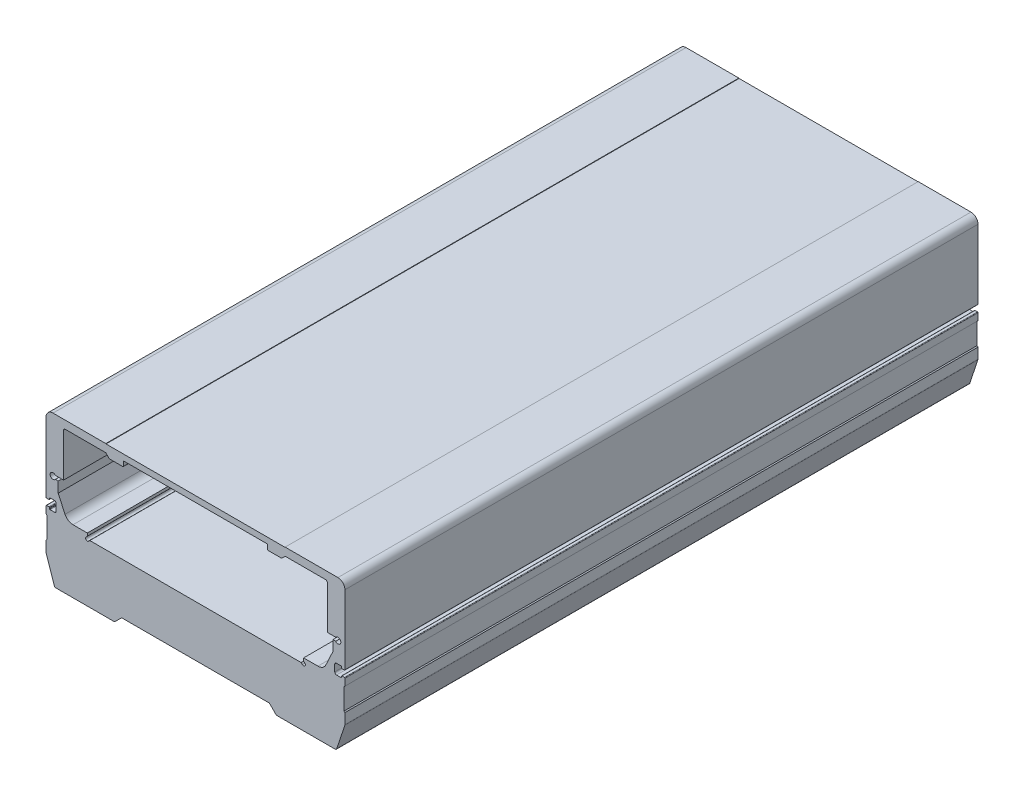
from build123d import *

# Parameters (mm, degrees)
EXTRUDE_1_DEPTH      = 360
HOLE_WIZARD_M8_D     = 6.8
HOLE_WIZARD_M8_DEPTH = 19.75
HOLE_WIZARD_M8_TIP   = 2.042926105


with BuildPart() as part:
    # Sketch 1 → Extrude 1 (new body)
    with BuildSketch(Plane.XY):
        with BuildLine():
            Line((-85, 77.3), (-85, 37.9))
            ThreePointArc((-85, 37.9), (-84.912132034, 37.687867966), (-84.7, 37.6))
            Line((-84.7, 37.6), (-83.3, 37.6))
            ThreePointArc((-83.3, 37.6), (-83.087867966, 37.687867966), (-83, 37.9))
            Line((-83, 37.9), (-83, 38.4))
            ThreePointArc((-83, 38.4), (-82.912132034, 38.612132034), (-82.7, 38.7))
            Line((-82.7, 38.7), (-80.2, 38.7))
            ThreePointArc((-80.2, 38.7), (-79.492893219, 38.407106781), (-79.2, 37.7))
            Line((-79.2, 37.7), (-79.2, 33.9))
            ThreePointArc((-79.2, 33.9), (-79.492893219, 33.192893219), (-80.2, 32.9))
            Line((-80.2, 32.9), (-82.7, 32.9))
            ThreePointArc((-82.7, 32.9), (-82.912132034, 32.987867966), (-83, 33.2))
            Line((-83, 33.2), (-83, 33.7))
            ThreePointArc((-83, 33.7), (-83.087867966, 33.912132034), (-83.3, 34))
            Line((-83.3, 34), (-84.7, 34))
            ThreePointArc((-84.7, 34), (-84.912132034, 33.912132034), (-85, 33.7))
            Line((-85, 33.7), (-85, 29.8))
            Line((-85, 29.8), (-84.5, 29.3))
            Line((-84.5, 29.3), (-84.5, 17.3))
            Line((-84.5, 17.3), (-85, 16.8))
            Line((-85, 16.8), (-85, 10.86227766))
            ThreePointArc((-85, 10.86227766), (-84.987087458, 10.702095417), (-84.948683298, 10.546049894))
            Line((-84.948683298, 10.546049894), (-80.327924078, -3.316227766))
            ThreePointArc((-80.327924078, -3.316227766), (-79.963951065, -3.811242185), (-79.37924078, -4))
            Line((-79.37924078, -4), (-46, -4))
            Line((-46, -4), (-42, 0))
            Line((-42, 0), (42, 0))
            Line((42, 0), (46, -4))
            Line((46, -4), (79.37924078, -4))
            ThreePointArc((79.37924078, -4), (79.963951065, -3.811242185), (80.327924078, -3.316227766))
            Line((80.327924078, -3.316227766), (84.948683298, 10.546049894))
            ThreePointArc((84.948683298, 10.546049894), (84.987087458, 10.702095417), (85, 10.86227766))
            Line((85, 10.86227766), (85, 16.8))
            Line((85, 16.8), (84.5, 17.3))
            Line((84.5, 17.3), (84.5, 29.3))
            Line((84.5, 29.3), (85, 29.8))
            Line((85, 29.8), (85, 33.7))
            ThreePointArc((85, 33.7), (84.912132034, 33.912132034), (84.7, 34))
            Line((84.7, 34), (83.3, 34))
            ThreePointArc((83.3, 34), (83.087867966, 33.912132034), (83, 33.7))
            Line((83, 33.7), (83, 33.2))
            ThreePointArc((83, 33.2), (82.912132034, 32.987867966), (82.7, 32.9))
            Line((82.7, 32.9), (80.2, 32.9))
            ThreePointArc((80.2, 32.9), (79.492893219, 33.192893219), (79.2, 33.9))
            Line((79.2, 33.9), (79.2, 37.7))
            ThreePointArc((79.2, 37.7), (79.492893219, 38.407106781), (80.2, 38.7))
            Line((80.2, 38.7), (82.7, 38.7))
            ThreePointArc((82.7, 38.7), (82.912132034, 38.612132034), (83, 38.4))
            Line((83, 38.4), (83, 37.9))
            ThreePointArc((83, 37.9), (83.087867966, 37.687867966), (83.3, 37.6))
            Line((83.3, 37.6), (84.7, 37.6))
            ThreePointArc((84.7, 37.6), (84.912132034, 37.687867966), (85, 37.9))
            Line((85, 37.9), (85, 77.3))
            ThreePointArc((85, 77.3), (83.828427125, 80.128427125), (81, 81.3))
            Line((81, 81.3), (51, 81.3))
            Line((51, 81.3), (50.868986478, 81.168986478))
            Line((50.868986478, 81.168986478), (-50.868986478, 81.168986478))
            Line((-50.868986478, 81.168986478), (-51, 81.3))
            Line((-51, 81.3), (-81, 81.3))
            ThreePointArc((-81, 81.3), (-83.828427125, 80.128427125), (-85, 77.3))
        make_face()
        with BuildLine():
            Line((-41, 77.8), (-41, 75.1))
            ThreePointArc((-41, 75.1), (-41.087867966, 74.887867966), (-41.3, 74.8))
            Line((-41.3, 74.8), (-49, 74.8))
            Line((-49, 74.8), (-51, 76.8))
            Line((-51, 76.8), (-74, 76.8))
            ThreePointArc((-74, 76.8), (-74.707106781, 76.507106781), (-75, 75.8))
            Line((-75, 75.8), (-75, 51.3))
            Line((-75, 51.3), (-79.687559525, 51.3))
            ThreePointArc((-79.687559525, 51.3), (-82.65, 50.3), (-79.687559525, 49.3))
            Line((-79.687559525, 49.3), (-78.1, 49.3))
            Line((-78.1, 49.3), (-78.1, 43.3))
            Line((-78.1, 43.3), (-74.176911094, 34.886908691))
            ThreePointArc((-74.176911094, 34.886908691), (-72.331870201, 32.783042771), (-69.645372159, 32))
            Line((-69.645372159, 32), (-61.5, 32))
            Line((-61.5, 32), (-61.5, 30.414213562))
            Line((-61.5, 30.414213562), (-62.207106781, 29.707106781))
            ThreePointArc((-62.207106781, 29.707106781), (-62.207106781, 28.292893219), (-60.792893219, 28.292893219))
            Line((-60.792893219, 28.292893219), (-60.085786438, 29))
            Line((-60.085786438, 29), (60.085786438, 29))
            Line((60.085786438, 29), (60.792893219, 28.292893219))
            ThreePointArc((60.792893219, 28.292893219), (62.207106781, 28.292893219), (62.207106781, 29.707106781))
            Line((62.207106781, 29.707106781), (61.5, 30.414213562))
            Line((61.5, 30.414213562), (61.5, 32))
            Line((61.5, 32), (69.645372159, 32))
            ThreePointArc((69.645372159, 32), (72.331870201, 32.783042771), (74.176911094, 34.886908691))
            Line((74.176911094, 34.886908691), (78.1, 43.3))
            Line((78.1, 43.3), (78.1, 49.3))
            Line((78.1, 49.3), (79.687559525, 49.3))
            ThreePointArc((79.687559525, 49.3), (82.65, 50.3), (79.687559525, 51.3))
            Line((79.687559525, 51.3), (75, 51.3))
            Line((75, 51.3), (75, 75.8))
            ThreePointArc((75, 75.8), (74.707106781, 76.507106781), (74, 76.8))
            Line((74, 76.8), (51, 76.8))
            Line((51, 76.8), (49, 74.8))
            Line((49, 74.8), (41.3, 74.8))
            ThreePointArc((41.3, 74.8), (41.087867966, 74.887867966), (41, 75.1))
            Line((41, 75.1), (41, 77.8))
            Line((41, 77.8), (-41, 77.8))
        make_face(mode=Mode.SUBTRACT)
    extrude(amount=-EXTRUDE_1_DEPTH)

    # Hole Wizard M8
    with Locations(Plane(origin=(0, -4, 0), x_dir=(-1, 0, 0), z_dir=(0, -1, 0))):
        with Locations((70, 295.5), (-70, 295.5), (70, 245.5), (-70, 245.5), (-70, 45.5), (70, 45.5), (-70, -154.5), (70, -154.5), (-70, -354.5), (70, -354.5), (-70, -554.5), (70, -554.5), (70, -754.5), (-70, -754.5), (-70, -954.5), (70, -954.5)):
            Hole(HOLE_WIZARD_M8_D / 2, depth=HOLE_WIZARD_M8_DEPTH)
            with Locations((0, 0, -(HOLE_WIZARD_M8_DEPTH + HOLE_WIZARD_M8_TIP / 2))):  # 118° drill point
                Cone(0, HOLE_WIZARD_M8_D / 2, HOLE_WIZARD_M8_TIP, mode=Mode.SUBTRACT)


solid = part.part
